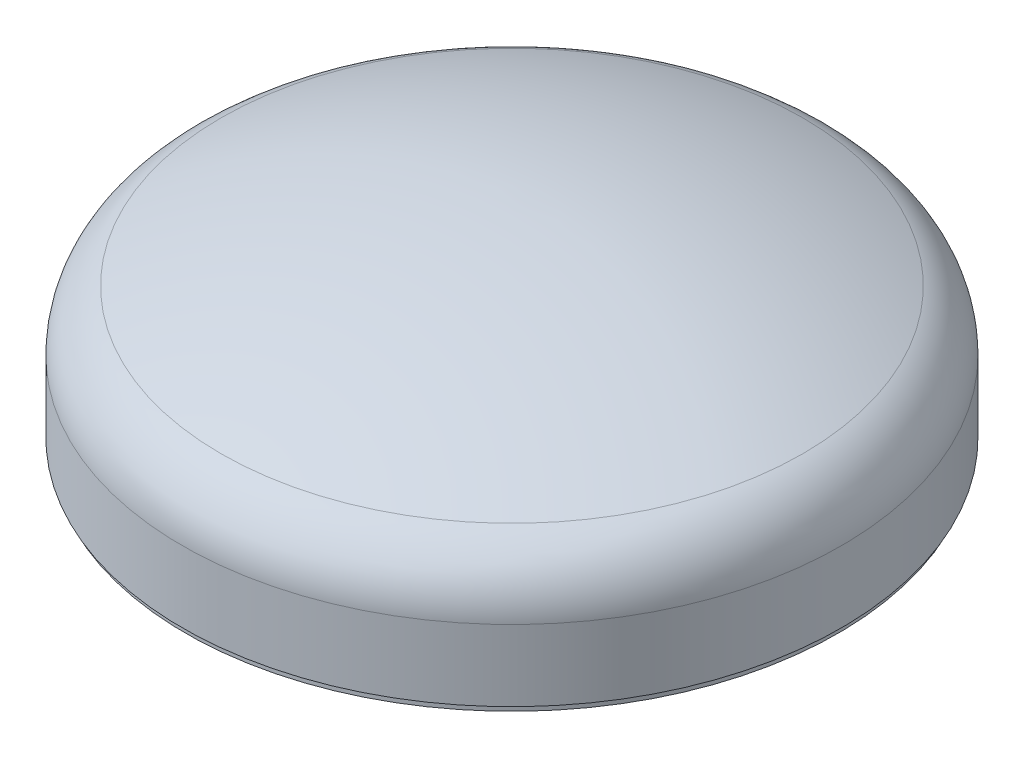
from build123d import *


with BuildPart() as part:
    # Esquisse1 → Base-R_volution (revolve)
    with BuildSketch(Plane.XY, mode=Mode.PRIVATE) as base_r_volution_sk:
        with BuildLine():
            Line((515, 899.368111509), (515, 793.37431449))
            Line((515, 793.37431449), (511.303847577, 791.240339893))
            ThreePointArc((511.303847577, 791.240339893), (510.205771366, 790.142263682), (509.803847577, 788.642263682))
            Line((509.803847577, 788.642263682), (509.803847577, 781.37431449))
            Line((509.803847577, 781.37431449), (515.803847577, 781.37431449))
            Line((515.803847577, 781.37431449), (515.803847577, 788.37431449))
            Line((515.803847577, 788.37431449), (521, 791.37431449))
            Line((521, 791.37431449), (521, 903.863374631))
            ThreePointArc((521, 903.863374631), (504.41506443, 960.500609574), (459.899497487, 999.245941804))
            ThreePointArc((459.899497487, 999.245941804), (235.403338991, 1074.516294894), (0, 1100))
            Line((0, 1100), (0, 1094))
            ThreePointArc((0, 1094), (231.696169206, 1069.183279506), (452.880566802, 995.859022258))
            ThreePointArc((452.880566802, 995.859022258), (498.127268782, 956.746940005), (515, 899.368111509))
        make_face()
    revolve(base_r_volution_sk.sketch.rotate(Axis((0, 0, 0), (0, 1, 0)), 90), axis=Axis((0, 0, 0), (0, 1, 0)))


solid = part.part
